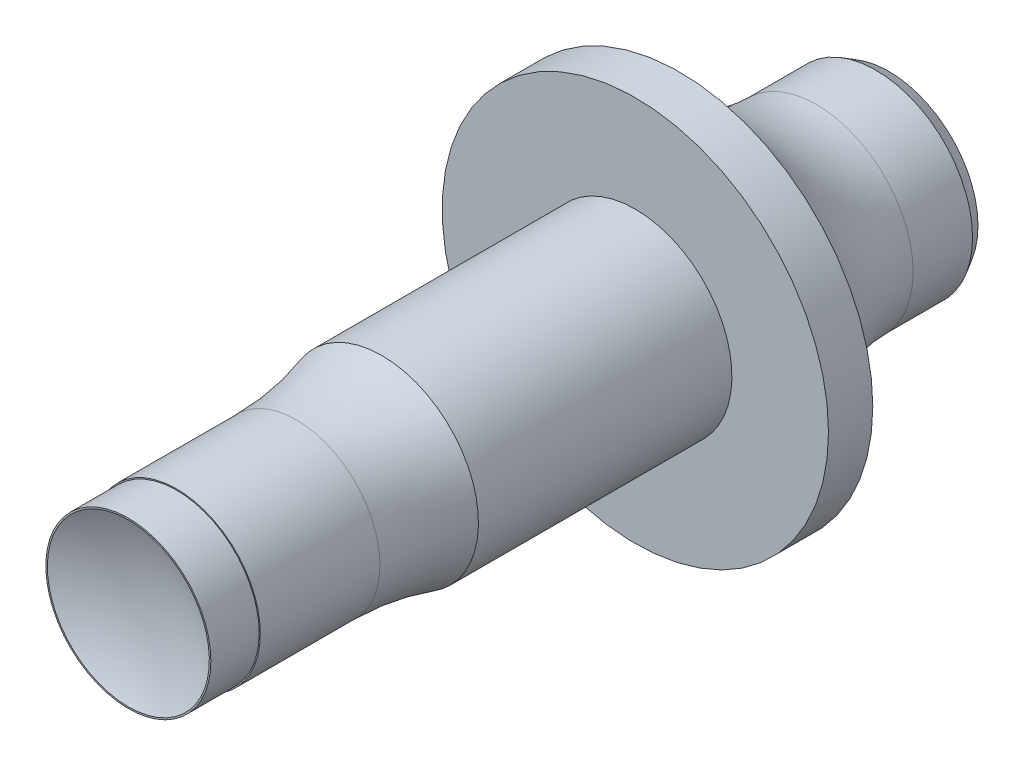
ISO-10303-21;
HEADER;
FILE_DESCRIPTION(('STEP AP214'),'2;1');
FILE_NAME('part.step','',(''),(''),'','','');
FILE_SCHEMA(('AUTOMOTIVE_DESIGN { 1 0 10303 214 1 1 1 1 }'));
ENDSEC;
DATA;
#1=APPLICATION_CONTEXT('core data for automotive mechanical design processes');
#2=APPLICATION_PROTOCOL_DEFINITION('international standard','automotive_design',2000,#1);
#3=PRODUCT_CONTEXT('',#1,'mechanical');
#4=PRODUCT('Part','Part','',(#3));
#5=PRODUCT_RELATED_PRODUCT_CATEGORY('part','',(#4));
#6=PRODUCT_DEFINITION_FORMATION('','',#4);
#7=PRODUCT_DEFINITION_CONTEXT('part definition',#1,'design');
#8=PRODUCT_DEFINITION('design','',#6,#7);
#9=PRODUCT_DEFINITION_SHAPE('','',#8);
#10=(LENGTH_UNIT() NAMED_UNIT(*) SI_UNIT(.MILLI.,.METRE.));
#11=(NAMED_UNIT(*) PLANE_ANGLE_UNIT() SI_UNIT($,.RADIAN.));
#12=(NAMED_UNIT(*) SI_UNIT($,.STERADIAN.) SOLID_ANGLE_UNIT());
#13=UNCERTAINTY_MEASURE_WITH_UNIT(LENGTH_MEASURE(1.E-05),#10,'distance_accuracy_value','');
#14=(GEOMETRIC_REPRESENTATION_CONTEXT(3) GLOBAL_UNCERTAINTY_ASSIGNED_CONTEXT((#13)) GLOBAL_UNIT_ASSIGNED_CONTEXT((#10,
#11,#12)) REPRESENTATION_CONTEXT('',''));
#15=CARTESIAN_POINT('',(0.,0.,0.));
#16=DIRECTION('',(0.,0.,1.));
#17=DIRECTION('',(1.,0.,0.));
#18=AXIS2_PLACEMENT_3D('',#15,#16,#17);
#19=CARTESIAN_POINT('',(0.,0.,-100.));
#20=DIRECTION('',(0.,0.,1.));
#21=DIRECTION('',(1.,0.,0.));
#22=AXIS2_PLACEMENT_3D('',#19,#20,#21);
#23=CYLINDRICAL_SURFACE('',#22,12.7);
#24=CARTESIAN_POINT('',(0.,0.,-33.3333333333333));
#25=DIRECTION('',(0.,0.,-1.));
#26=DIRECTION('',(0.,1.,0.));
#27=AXIS2_PLACEMENT_3D('',#24,#25,#26);
#28=CIRCLE('',#27,12.7);
#29=CARTESIAN_POINT('',(0.,12.7,-33.3333333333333));
#30=VERTEX_POINT('',#29);
#31=EDGE_CURVE('E77',#30,#30,#28,.T.);
#32=ORIENTED_EDGE('',*,*,#31,.T.);
#33=EDGE_LOOP('',(#32));
#34=FACE_BOUND('',#33,.T.);
#35=CARTESIAN_POINT('',(0.,0.,-66.6666666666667));
#36=DIRECTION('',(0.,0.,-1.));
#37=DIRECTION('',(-1.,0.,0.));
#38=AXIS2_PLACEMENT_3D('',#35,#36,#37);
#39=CIRCLE('',#38,12.7);
#40=CARTESIAN_POINT('',(-12.7,0.,-66.6666666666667));
#41=VERTEX_POINT('',#40);
#42=EDGE_CURVE('E44',#41,#41,#39,.F.);
#43=ORIENTED_EDGE('',*,*,#42,.T.);
#44=EDGE_LOOP('',(#43));
#45=FACE_BOUND('',#44,.T.);
#46=ADVANCED_FACE('F40',(#34,#45),#23,.T.);
#47=CARTESIAN_POINT('',(0.,0.,-33.3333333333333));
#48=DIRECTION('',(0.,0.,1.));
#49=DIRECTION('',(1.,0.,0.));
#50=AXIS2_PLACEMENT_3D('',#47,#48,#49);
#51=CYLINDRICAL_SURFACE('',#50,11.);
#52=CARTESIAN_POINT('',(0.,0.,-22.0794451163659));
#53=DIRECTION('',(0.,0.,1.));
#54=DIRECTION('',(0.,-1.,0.));
#55=AXIS2_PLACEMENT_3D('',#52,#53,#54);
#56=CIRCLE('',#55,11.);
#57=CARTESIAN_POINT('',(0.,-11.,-22.0794451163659));
#58=VERTEX_POINT('',#57);
#59=EDGE_CURVE('E12',#58,#58,#56,.F.);
#60=ORIENTED_EDGE('',*,*,#59,.F.);
#61=EDGE_LOOP('',(#60));
#62=FACE_BOUND('',#61,.T.);
#63=CARTESIAN_POINT('',(0.,0.,-6.35));
#64=DIRECTION('',(0.,0.,1.));
#65=DIRECTION('',(1.,0.,0.));
#66=AXIS2_PLACEMENT_3D('',#63,#64,#65);
#67=CIRCLE('',#66,11.);
#68=CARTESIAN_POINT('',(11.,0.,-6.35));
#69=VERTEX_POINT('',#68);
#70=EDGE_CURVE('E61',#69,#69,#67,.F.);
#71=ORIENTED_EDGE('',*,*,#70,.T.);
#72=EDGE_LOOP('',(#71));
#73=FACE_BOUND('',#72,.T.);
#74=ADVANCED_FACE('F105',(#62,#73),#51,.T.);
#75=CARTESIAN_POINT('',(0.,0.,-6.35));
#76=DIRECTION('',(0.,0.,1.));
#77=DIRECTION('',(1.,0.,0.));
#78=AXIS2_PLACEMENT_3D('',#75,#76,#77);
#79=PLANE('',#78);
#80=ORIENTED_EDGE('',*,*,#70,.F.);
#81=EDGE_LOOP('',(#80));
#82=FACE_BOUND('',#81,.T.);
#83=CARTESIAN_POINT('',(0.,0.,-6.35));
#84=DIRECTION('',(0.,0.,1.));
#85=DIRECTION('',(1.,0.,0.));
#86=AXIS2_PLACEMENT_3D('',#83,#84,#85);
#87=CIRCLE('',#86,10.85);
#88=CARTESIAN_POINT('',(10.85,0.,-6.35));
#89=VERTEX_POINT('',#88);
#90=EDGE_CURVE('E65',#89,#89,#87,.T.);
#91=ORIENTED_EDGE('',*,*,#90,.F.);
#92=EDGE_LOOP('',(#91));
#93=FACE_BOUND('',#92,.T.);
#94=ADVANCED_FACE('F110',(#82,#93),#79,.T.);
#95=CARTESIAN_POINT('',(0.,0.,-6.35));
#96=DIRECTION('',(0.,0.,1.));
#97=DIRECTION('',(1.,0.,0.));
#98=AXIS2_PLACEMENT_3D('',#95,#96,#97);
#99=CYLINDRICAL_SURFACE('',#98,10.85);
#100=ORIENTED_EDGE('',*,*,#90,.T.);
#101=EDGE_LOOP('',(#100));
#102=FACE_BOUND('',#101,.T.);
#103=CARTESIAN_POINT('',(0.,0.,0.));
#104=DIRECTION('',(0.,0.,1.));
#105=DIRECTION('',(1.,0.,0.));
#106=AXIS2_PLACEMENT_3D('',#103,#104,#105);
#107=CIRCLE('',#106,10.85);
#108=CARTESIAN_POINT('',(10.85,0.,0.));
#109=VERTEX_POINT('',#108);
#110=EDGE_CURVE('E66',#109,#109,#107,.T.);
#111=ORIENTED_EDGE('',*,*,#110,.F.);
#112=EDGE_LOOP('',(#111));
#113=FACE_BOUND('',#112,.T.);
#114=ADVANCED_FACE('F147',(#102,#113),#99,.T.);
#115=CARTESIAN_POINT('',(0.,0.,0.));
#116=DIRECTION('',(0.,0.,1.));
#117=DIRECTION('',(1.,0.,0.));
#118=AXIS2_PLACEMENT_3D('',#115,#116,#117);
#119=PLANE('',#118);
#120=CARTESIAN_POINT('',(0.,0.,0.));
#121=DIRECTION('',(0.,0.,1.));
#122=DIRECTION('',(0.,-1.,0.));
#123=AXIS2_PLACEMENT_3D('',#120,#121,#122);
#124=CIRCLE('',#123,10.65);
#125=CARTESIAN_POINT('',(0.,-10.65,0.));
#126=VERTEX_POINT('',#125);
#127=EDGE_CURVE('E70',#126,#126,#124,.T.);
#128=ORIENTED_EDGE('',*,*,#127,.F.);
#129=EDGE_LOOP('',(#128));
#130=FACE_BOUND('',#129,.T.);
#131=ORIENTED_EDGE('',*,*,#110,.T.);
#132=EDGE_LOOP('',(#131));
#133=FACE_BOUND('',#132,.T.);
#134=ADVANCED_FACE('F145',(#130,#133),#119,.T.);
#135=CARTESIAN_POINT('',(0.,0.,23.0594340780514));
#136=DIRECTION('',(0.,0.,1.));
#137=DIRECTION('',(0.,-1.,0.));
#138=AXIS2_PLACEMENT_3D('',#135,#136,#137);
#139=SPHERICAL_SURFACE('',#138,25.4);
#140=ORIENTED_EDGE('',*,*,#127,.T.);
#141=EDGE_LOOP('',(#140));
#142=FACE_BOUND('',#141,.T.);
#143=ADVANCED_FACE('F142',(#142),#139,.F.);
#144=CARTESIAN_POINT('',(0.,0.,-22.0794451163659));
#145=DIRECTION('',(0.,0.,-1.));
#146=DIRECTION('',(0.,1.,0.));
#147=AXIS2_PLACEMENT_3D('',#144,#145,#146);
#148=TOROIDAL_SURFACE('',#147,49.1,38.1);
#149=ORIENTED_EDGE('',*,*,#59,.T.);
#150=EDGE_LOOP('',(#149));
#151=FACE_BOUND('',#150,.T.);
#152=ORIENTED_EDGE('',*,*,#31,.F.);
#153=EDGE_LOOP('',(#152));
#154=FACE_BOUND('',#153,.T.);
#155=ADVANCED_FACE('F123',(#151,#154),#148,.F.);
#156=CARTESIAN_POINT('',(0.,0.,-66.6666666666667));
#157=DIRECTION('',(0.,0.,-1.));
#158=DIRECTION('',(-1.,0.,0.));
#159=AXIS2_PLACEMENT_3D('',#156,#157,#158);
#160=PLANE('',#159);
#161=ORIENTED_EDGE('',*,*,#42,.F.);
#162=EDGE_LOOP('',(#161));
#163=FACE_BOUND('',#162,.T.);
#164=CARTESIAN_POINT('',(0.,0.,-66.6666666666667));
#165=DIRECTION('',(0.,0.,1.));
#166=DIRECTION('',(1.,0.,0.));
#167=AXIS2_PLACEMENT_3D('',#164,#165,#166);
#168=CIRCLE('',#167,25.4);
#169=CARTESIAN_POINT('',(25.4,0.,-66.6666666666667));
#170=VERTEX_POINT('',#169);
#171=EDGE_CURVE('E80',#170,#170,#168,.T.);
#172=ORIENTED_EDGE('',*,*,#171,.T.);
#173=EDGE_LOOP('',(#172));
#174=FACE_BOUND('',#173,.T.);
#175=ADVANCED_FACE('F119',(#163,#174),#160,.F.);
#176=CARTESIAN_POINT('',(0.,0.,-66.6666666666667));
#177=DIRECTION('',(0.,0.,1.));
#178=DIRECTION('',(1.,0.,0.));
#179=AXIS2_PLACEMENT_3D('',#176,#177,#178);
#180=CYLINDRICAL_SURFACE('',#179,25.4);
#181=ORIENTED_EDGE('',*,*,#171,.F.);
#182=EDGE_LOOP('',(#181));
#183=FACE_BOUND('',#182,.T.);
#184=CARTESIAN_POINT('',(0.,0.,-72.4908338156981));
#185=DIRECTION('',(0.,0.,1.));
#186=DIRECTION('',(1.,0.,0.));
#187=AXIS2_PLACEMENT_3D('',#184,#185,#186);
#188=CIRCLE('',#187,25.4);
#189=CARTESIAN_POINT('',(25.4,0.,-72.4908338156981));
#190=VERTEX_POINT('',#189);
#191=EDGE_CURVE('E84',#190,#190,#188,.T.);
#192=ORIENTED_EDGE('',*,*,#191,.T.);
#193=EDGE_LOOP('',(#192));
#194=FACE_BOUND('',#193,.T.);
#195=ADVANCED_FACE('F122',(#183,#194),#180,.T.);
#196=CARTESIAN_POINT('',(0.,0.,-90.4866666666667));
#197=DIRECTION('',(0.,0.,1.));
#198=DIRECTION('',(1.,0.,0.));
#199=AXIS2_PLACEMENT_3D('',#196,#197,#198);
#200=TOROIDAL_SURFACE('',#199,31.8,19.1);
#201=ORIENTED_EDGE('',*,*,#191,.F.);
#202=EDGE_LOOP('',(#201));
#203=FACE_BOUND('',#202,.T.);
#204=CARTESIAN_POINT('',(0.,0.,-90.4866666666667));
#205=DIRECTION('',(0.,0.,1.));
#206=DIRECTION('',(1.,0.,0.));
#207=AXIS2_PLACEMENT_3D('',#204,#205,#206);
#208=CIRCLE('',#207,12.7);
#209=CARTESIAN_POINT('',(12.7,0.,-90.4866666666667));
#210=VERTEX_POINT('',#209);
#211=EDGE_CURVE('E88',#210,#210,#208,.T.);
#212=ORIENTED_EDGE('',*,*,#211,.T.);
#213=EDGE_LOOP('',(#212));
#214=FACE_BOUND('',#213,.T.);
#215=ADVANCED_FACE('F93',(#203,#214),#200,.F.);
#216=CARTESIAN_POINT('',(0.,0.,-100.));
#217=DIRECTION('',(0.,0.,1.));
#218=DIRECTION('',(1.,0.,0.));
#219=AXIS2_PLACEMENT_3D('',#216,#217,#218);
#220=PLANE('',#219);
#221=CARTESIAN_POINT('',(0.,0.,-100.));
#222=DIRECTION('',(0.,0.,1.));
#223=DIRECTION('',(1.,0.,0.));
#224=AXIS2_PLACEMENT_3D('',#221,#222,#223);
#225=CIRCLE('',#224,11.7223535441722);
#226=CARTESIAN_POINT('',(11.7223535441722,0.,-100.));
#227=VERTEX_POINT('',#226);
#228=EDGE_CURVE('E49',#227,#227,#225,.F.);
#229=ORIENTED_EDGE('',*,*,#228,.T.);
#230=EDGE_LOOP('',(#229));
#231=FACE_BOUND('',#230,.T.);
#232=ADVANCED_FACE('F101',(#231),#220,.F.);
#233=CARTESIAN_POINT('',(0.,0.,-98.3066666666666));
#234=DIRECTION('',(0.,0.,1.));
#235=DIRECTION('',(1.,0.,0.));
#236=AXIS2_PLACEMENT_3D('',#233,#234,#235);
#237=CONICAL_SURFACE('',#236,12.7,0.5235987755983);
#238=ORIENTED_EDGE('',*,*,#228,.F.);
#239=EDGE_LOOP('',(#238));
#240=FACE_BOUND('',#239,.T.);
#241=CARTESIAN_POINT('',(0.,0.,-98.3066666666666));
#242=DIRECTION('',(0.,0.,1.));
#243=DIRECTION('',(1.,0.,0.));
#244=AXIS2_PLACEMENT_3D('',#241,#242,#243);
#245=CIRCLE('',#244,12.7);
#246=CARTESIAN_POINT('',(12.7,0.,-98.3066666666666));
#247=VERTEX_POINT('',#246);
#248=EDGE_CURVE('E56',#247,#247,#245,.T.);
#249=ORIENTED_EDGE('',*,*,#248,.F.);
#250=EDGE_LOOP('',(#249));
#251=FACE_BOUND('',#250,.T.);
#252=ADVANCED_FACE('F42',(#240,#251),#237,.T.);
#253=ORIENTED_EDGE('',*,*,#248,.T.);
#254=EDGE_LOOP('',(#253));
#255=FACE_BOUND('',#254,.T.);
#256=ORIENTED_EDGE('',*,*,#211,.F.);
#257=EDGE_LOOP('',(#256));
#258=FACE_BOUND('',#257,.T.);
#259=ADVANCED_FACE('F95',(#255,#258),#23,.T.);
#260=CLOSED_SHELL('',(#46,#74,#94,#114,#134,#143,#155,#175,#195,#215,#232,#252,#259));
#261=MANIFOLD_SOLID_BREP('B2',#260);
#262=ADVANCED_BREP_SHAPE_REPRESENTATION('',(#18,#261),#14);
#263=SHAPE_DEFINITION_REPRESENTATION(#9,#262);
ENDSEC;
END-ISO-10303-21;
